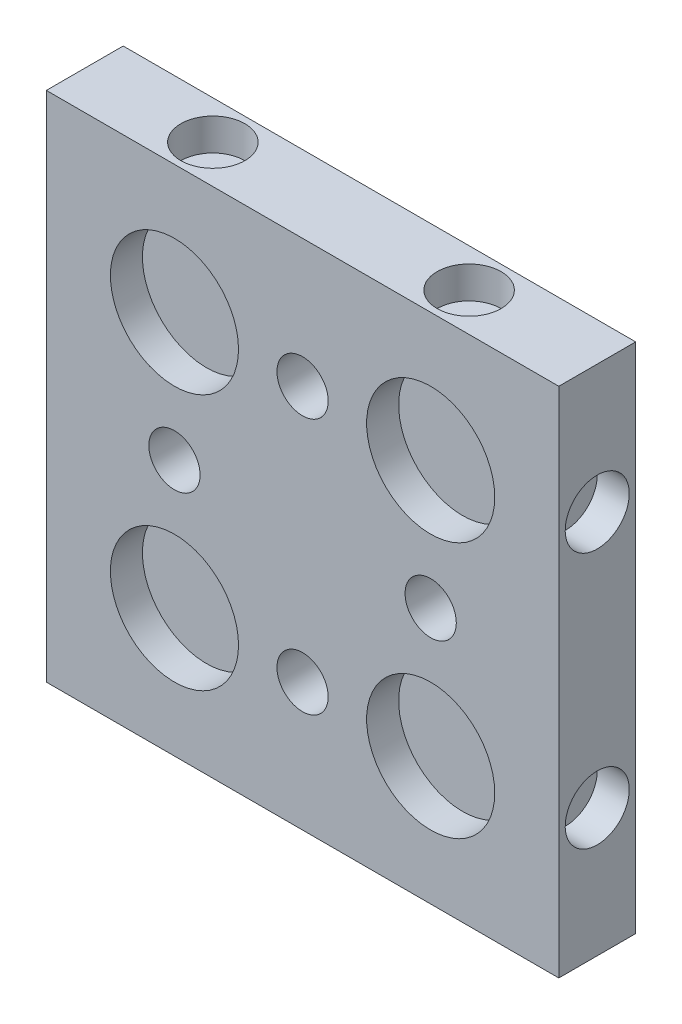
from build123d import *

# Parameters (mm, degrees)
SKETCH1_W           = 50.8
SKETCH1_H           = 50.8
BOSS_EXTRUDE1_DEPTH = 7.62
SKETCH3_R           = 2.54
CUT_EXTRUDE1_DEPTH  = 40.985491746
SKETCH4_R           = 6.35
CUT_EXTRUDE2_DEPTH  = 3.175
SKETCH5_R           = 3.175
CUT_EXTRUDE3_DEPTH  = 3.175
SKETCH6_R           = 3.175
CUT_EXTRUDE4_DEPTH  = 3.175
CUT_EXTRUDE5_START  = -3.175
SKETCH7_R           = 3.175
CUT_EXTRUDE5_DEPTH  = 3.175
CUT_EXTRUDE6_START  = -3.175
SKETCH8_R           = 3.175
CUT_EXTRUDE6_DEPTH  = 3.175


with BuildPart() as part:
    # Sketch1 → Boss-Extrude1 (new body)
    with BuildSketch(Plane.XY):
        with Locations((4.049275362, 0.552173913)):
            Rectangle(SKETCH1_W, SKETCH1_H)
    extrude(amount=BOSS_EXTRUDE1_DEPTH)

    # Sketch3 → Cut-Extrude1 (cut, through all)
    with BuildSketch(Plane.XY.offset(7.62)):
        with Locations((-8.650724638, 0.552173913)):
            Circle(SKETCH3_R)
        with Locations((4.049275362, 13.252173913)):
            Circle(SKETCH3_R)
        with Locations((4.049275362, -12.147826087)):
            Circle(SKETCH3_R)
        with Locations((16.749275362, 0.552173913)):
            Circle(SKETCH3_R)
    extrude(amount=-CUT_EXTRUDE1_DEPTH, mode=Mode.SUBTRACT)

    # Sketch4 → Cut-Extrude2 (cut)
    with BuildSketch(Plane.XY.offset(7.62)):
        with Locations((-8.650724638, 13.252173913)):
            Circle(SKETCH4_R)
        with Locations((16.749275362, 13.252173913)):
            Circle(SKETCH4_R)
        with Locations((16.749275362, -12.147826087)):
            Circle(SKETCH4_R)
        with Locations((-8.650724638, -12.147826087)):
            Circle(SKETCH4_R)
    extrude(amount=-CUT_EXTRUDE2_DEPTH, mode=Mode.SUBTRACT)

    # Sketch5 → Cut-Extrude3 (cut)
    with BuildSketch(Plane(origin=(29.449275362, 0, 0), x_dir=(0, 0, -1), z_dir=(1, 0, 0))):
        with Locations(Location((-3.81, 13.252173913, 0), (0, 0, 90))):
            Circle(SKETCH5_R)
        with Locations(Location((-3.81, -12.147826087, 0), (0, 0, 90))):
            Circle(SKETCH5_R)
    extrude(amount=-CUT_EXTRUDE3_DEPTH, mode=Mode.SUBTRACT)

    # Sketch6 → Cut-Extrude4 (cut)
    with BuildSketch(Plane(origin=(0, -24.847826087, 0), x_dir=(-1, 0, 0), z_dir=(0, -1, 0))):
        with Locations(Location((8.650724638, -3.81, 0), (0, 0, 90))):
            Circle(SKETCH6_R)
        with Locations(Location((-16.749275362, -3.81, 0), (0, 0, 90))):
            Circle(SKETCH6_R)
    extrude(amount=-CUT_EXTRUDE4_DEPTH, mode=Mode.SUBTRACT)

    # Sketch7 → Cut-Extrude5 (cut)
    with BuildSketch(Plane.ZY.offset(21.350724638).offset(CUT_EXTRUDE5_START)):
        with Locations(Location((3.81, 13.252173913, 0), (0, 0, 90))):
            Circle(SKETCH7_R)
        with Locations(Location((3.81, -12.147826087, 0), (0, 0, 90))):
            Circle(SKETCH7_R)
    extrude(amount=CUT_EXTRUDE5_DEPTH, mode=Mode.SUBTRACT)

    # Sketch8 → Cut-Extrude6 (cut)
    with BuildSketch(Plane(origin=(0, 25.952173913, 0), x_dir=(1, 0, 0), z_dir=(0, 1, 0)).offset(CUT_EXTRUDE6_START)):
        with Locations(Location((-8.650724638, -3.81, 0), (0, 0, 90))):
            Circle(SKETCH8_R)
        with Locations(Location((16.749275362, -3.81, 0), (0, 0, 90))):
            Circle(SKETCH8_R)
    extrude(amount=CUT_EXTRUDE6_DEPTH, mode=Mode.SUBTRACT)


solid = part.part
